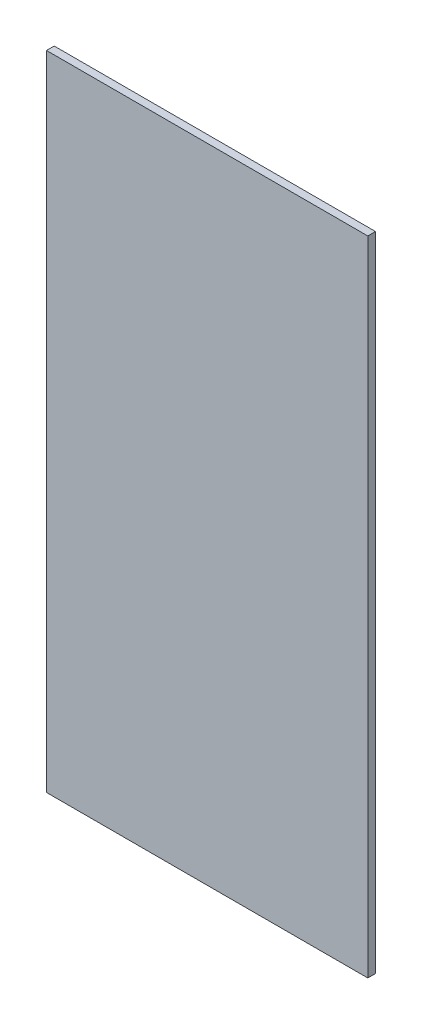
from build123d import *

# Parameters (mm, degrees)
ESBO_O1_W                = 250
ESBO_O1_H                = 500
RESSALTO_EXTRUS_O1_DEPTH = 6


with BuildPart() as part:
    # Esbo_o1 → Ressalto-extrus_o1 (new body)
    with BuildSketch(Plane.XY):
        with Locations((125, -250)):
            Rectangle(ESBO_O1_W, ESBO_O1_H)
    extrude(amount=RESSALTO_EXTRUS_O1_DEPTH)


solid = part.part
